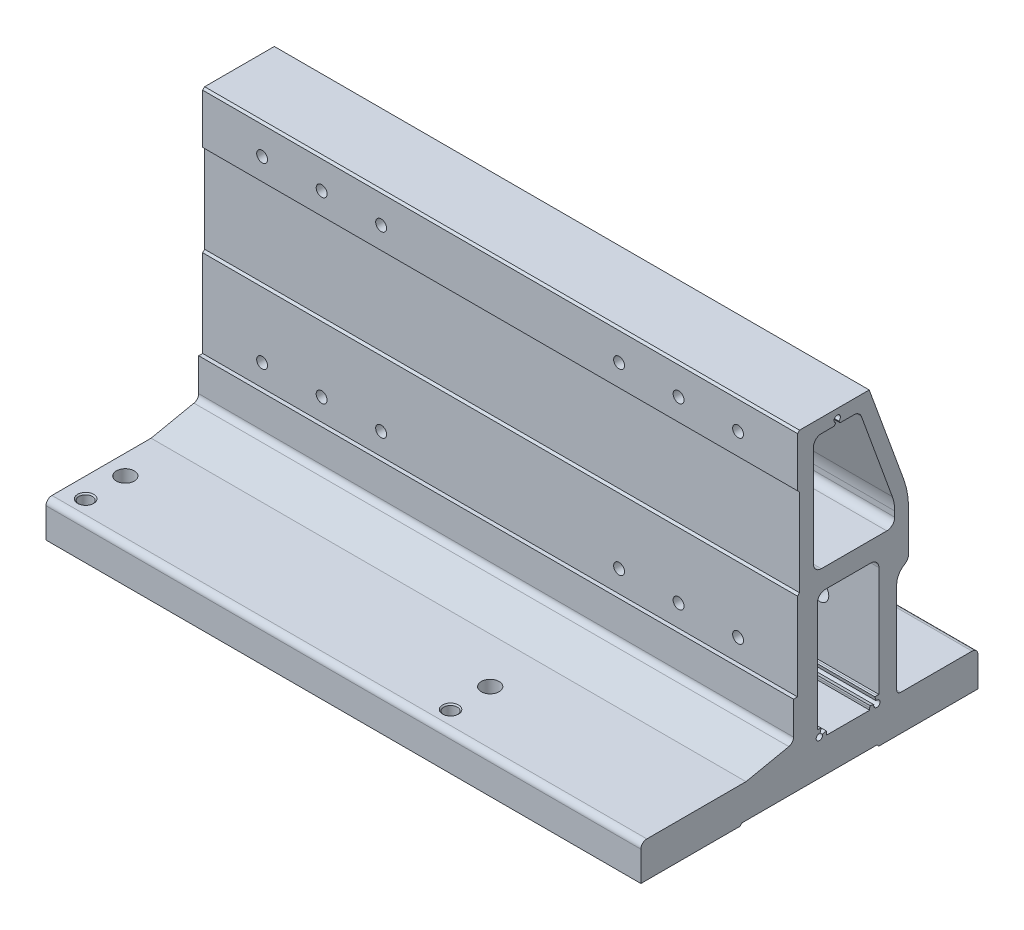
from build123d import *

# Parameters (mm, degrees)
EXTRUDE_1_DEPTH                = 150
HOLE_WIZARD_M5_1_D             = 5.5
HOLE_WIZARD_M5_1_CBORE_D       = 9.5
HOLE_WIZARD_M5_1_CBORE_DEPTH   = 49
PATTERN_LINEAR_1_COUNT         = 2
PATTERN_LINEAR_1_PITCH         = 180
HOLE_WIZARD_M5_1_2_D           = 4.2
HOLE_WIZARD_M5_1_2_DEPTH       = 12
HOLE_WIZARD_M5_1_2_CSINK_D     = 5.05
HOLE_WIZARD_M5_1_2_CSINK_ANGLE = 90
HOLE_WIZARD_M5_1_2_TIP         = 1.2618073
HOLE_WIZARD_M8_1_AT_2_COUNT    = 2
HOLE_WIZARD_M8_1_AT_2_PITCH    = 184
HOLE_WIZARD_M8_1_AT_3_COUNT    = 2
HOLE_WIZARD_M8_1_AT_3_PITCH    = 150
HOLE_WIZARD_M8_1_AT_4_COUNT    = 2
HOLE_WIZARD_M8_1_AT_4_PITCH    = 237.394186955
F_6_0MM_1_D                    = 6
F_6_0MM_1_DEPTH                = 10
F_6_0MM_1_TIP                  = 1.802581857
HOLE_WIZARD_9_0_9_1_D          = 9


with BuildPart() as part:
    # Sketch 1 → Extrude 1 (new, symmetric)
    with BuildSketch(Plane(origin=(0, 0, 0), x_dir=(0, 0, -1), z_dir=(1, 0, 0))):
        with BuildLine():
            Line((-6, 131), (-5, 130))
            Line((-5, 130), (-5, 86))
            Line((-5, 86), (-6, 85))
            Line((-6, 85), (-6, 40.999831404))
            Line((-6, 40.999831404), (-8, 40.999831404))
            Line((-8, 40.999831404), (-8, 24.439412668))
            ThreePointArc((-8, 24.439412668), (-8.672384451, 22.546741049), (-10.388137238, 21.502471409))
            Line((-10.388137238, 21.502471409), (-32, 17))
            Line((-32, 17), (-82, 17))
            ThreePointArc((-82, 17), (-84.121320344, 16.121320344), (-85, 14))
            Line((-85, 14), (-85, -1))
            Line((-85, -1), (-35, -1))
            Line((-35, -1), (-34, 0))
            Line((-34, 0), (34, 0))
            Line((34, 0), (35, -1))
            Line((35, -1), (85, -1))
            Line((85, -1), (85, 14))
            ThreePointArc((85, 14), (84.121320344, 16.121320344), (82, 17))
            Line((82, 17), (46, 17))
            ThreePointArc((46, 17), (44.585786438, 17.585786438), (44, 19))
            Line((44, 19), (44, 65))
            ThreePointArc((44, 65), (45.07179677, 69), (48, 71.92820323))
            ThreePointArc((48, 71.92820323), (49.464101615, 73.392304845), (50, 75.392304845))
            Line((50, 75.392304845), (50, 95.442037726))
            ThreePointArc((50, 95.442037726), (49.391487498, 102.392628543), (47.584464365, 109.131743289))
            Line((47.584464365, 109.131743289), (30.149007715, 156.999997))
            Line((30.149007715, 156.999997), (-5, 156.999997))
            Line((-5, 156.999997), (-6, 155.999997))
            Line((-6, 155.999997), (-6, 131))
        make_face()
        with BuildLine():
            Line((2, 95), (2, 146))
            ThreePointArc((2, 146), (3.171572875, 148.828427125), (6, 150))
            Line((6, 150), (12.556626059, 150))
            Line((12.556626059, 150), (13.2, 151.114356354))
            ThreePointArc((13.2, 151.114356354), (14, 154.099997), (14.8, 151.114356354))
            Line((14.8, 151.114356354), (15.443373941, 150))
            Line((15.443373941, 150), (22.448664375, 150))
            ThreePointArc((22.448664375, 150), (24.742582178, 149.276879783), (26.207110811, 147.368970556))
            Line((26.207110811, 147.368970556), (41.792232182, 104.580728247))
            ThreePointArc((41.792232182, 104.580728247), (42.695743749, 101.211170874), (43, 97.735875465))
            Line((43, 97.735875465), (43, 95))
            ThreePointArc((43, 95), (41.828427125, 92.171572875), (39, 91))
            Line((39, 91), (6, 91))
            ThreePointArc((6, 91), (3.171572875, 92.171572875), (2, 95))
        make_face(mode=Mode.SUBTRACT)
        with BuildLine():
            Line((8, 81), (31, 81))
            ThreePointArc((31, 81), (33.828427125, 79.828427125), (35, 77))
            Line((35, 77), (35, 21.6))
            Line((35, 21.6), (34, 21.6))
            ThreePointArc((34, 21.6), (33.530105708, 21.569201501), (33.068251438, 21.477332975))
            Line((33.068251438, 21.477332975), (33.585889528, 19.545481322))
            ThreePointArc((33.585889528, 19.545481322), (35.13137085, 16.86862915), (32.454518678, 18.414110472))
            Line((32.454518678, 18.414110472), (30.522667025, 18.931748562))
            ThreePointArc((30.522667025, 18.931748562), (30.430798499, 18.469894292), (30.4, 18))
            Line((30.4, 18), (30.4, 17))
            Line((30.4, 17), (8.6, 17))
            Line((8.6, 17), (8.6, 18))
            ThreePointArc((8.6, 18), (8.569201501, 18.469894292), (8.477332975, 18.931748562))
            Line((8.477332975, 18.931748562), (6.545481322, 18.414110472))
            ThreePointArc((6.545481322, 18.414110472), (3.86862915, 16.86862915), (5.414110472, 19.545481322))
            Line((5.414110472, 19.545481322), (5.931748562, 21.477332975))
            ThreePointArc((5.931748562, 21.477332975), (5.469894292, 21.569201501), (5, 21.6))
            Line((5, 21.6), (4, 21.6))
            Line((4, 21.6), (4, 77))
            ThreePointArc((4, 77), (5.171572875, 79.828427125), (8, 81))
        make_face(mode=Mode.SUBTRACT)
    extrude(amount=EXTRUDE_1_DEPTH, both=True)

    # Hole Wizard M5 _ _ _ _ _1 (through all)
    with Locations(Plane(origin=(0, 0, -50), x_dir=(-1, 0, 0), z_dir=(0, 0, -1))):
        with Locations((-120, 142), (-90, 142), (-60, 142), (-120, 52), (-90, 52), (-60, 52)):
            hole_wizard_m5_1 = CounterBoreHole(HOLE_WIZARD_M5_1_D / 2, HOLE_WIZARD_M5_1_CBORE_D / 2, HOLE_WIZARD_M5_1_CBORE_DEPTH)

    # Pattern Linear 1: Hole Wizard M5 _ _ _ _ _1 ×2
    with Locations(*[(-i * PATTERN_LINEAR_1_PITCH, 0, 0) for i in range(1, PATTERN_LINEAR_1_COUNT)]):
        add(hole_wizard_m5_1, mode=Mode.SUBTRACT)

    # Hole Wizard M5 _ _1 2
    with Locations(Plane.ZY.offset(150)):
        with Locations((-45, 8), (-9, 8)):
            CounterSinkHole(HOLE_WIZARD_M5_1_2_D / 2, HOLE_WIZARD_M5_1_2_CSINK_D / 2, depth=HOLE_WIZARD_M5_1_2_DEPTH, counter_sink_angle=HOLE_WIZARD_M5_1_2_CSINK_ANGLE)
            with Locations((0, 0, -(HOLE_WIZARD_M5_1_2_DEPTH + HOLE_WIZARD_M5_1_2_TIP / 2))):  # 118° drill point
                Cone(0, HOLE_WIZARD_M5_1_2_D / 2, HOLE_WIZARD_M5_1_2_TIP, mode=Mode.SUBTRACT)

    # Sketch 7 → Hole Wizard M8 _ _1 (revolve, cut)
    with BuildSketch(Plane(origin=(-140, -1, 75), x_dir=(0, 0, -1), z_dir=(1, 0, 0))):
        Polygon((0, 0), (0, 18), (4.025, 18), (3.4, 17.375), (3.4, 0.625), (4.025, 0), align=None)
    hole_wizard_m8_1 = revolve(axis=Axis((-140, -7.35, 75), (0, 1, 0)), mode=Mode.SUBTRACT)

    # Hole Wizard M8 _ _1 at 2: Hole Wizard M8 _ _1 ×2
    with Locations(*[(i * HOLE_WIZARD_M8_1_AT_2_PITCH, 0, 0) for i in range(1, HOLE_WIZARD_M8_1_AT_2_COUNT)]):
        add(hole_wizard_m8_1, mode=Mode.SUBTRACT)

    # Hole Wizard M8 _ _1 at 3: Hole Wizard M8 _ _1 ×2
    with Locations(*[(0, 0, -i * HOLE_WIZARD_M8_1_AT_3_PITCH) for i in range(1, HOLE_WIZARD_M8_1_AT_3_COUNT)]):
        add(hole_wizard_m8_1, mode=Mode.SUBTRACT)

    # Hole Wizard M8 _ _1 at 4: Hole Wizard M8 _ _1 ×2
    with Locations(*[Vector(0.7750821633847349, 0, -0.6318604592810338) * (i * HOLE_WIZARD_M8_1_AT_4_PITCH) for i in range(1, HOLE_WIZARD_M8_1_AT_4_COUNT)]):
        add(hole_wizard_m8_1, mode=Mode.SUBTRACT)

    # 6.0mm _ _1
    with Locations(Plane(origin=(0, 0, 0), x_dir=(-1, 0, 0), z_dir=(0, -1, 0))):
        with Locations((-44, 0), (140, 0)):
            Hole(F_6_0MM_1_D / 2, depth=F_6_0MM_1_DEPTH)
            with Locations((0, 0, -(F_6_0MM_1_DEPTH + F_6_0MM_1_TIP / 2))):  # 118° drill point
                Cone(0, F_6_0MM_1_D / 2, F_6_0MM_1_TIP, mode=Mode.SUBTRACT)

    # Hole Wizard 9.0 _9_ _ _1 (through all)
    with Locations(Plane(origin=(0, -1, 0), x_dir=(-1, 0, 0), z_dir=(0, -1, 0))):
        with Locations((140, -55), (-44, -55), (140, 55), (-44, 55)):
            Hole(HOLE_WIZARD_9_0_9_1_D / 2)


solid = part.part
